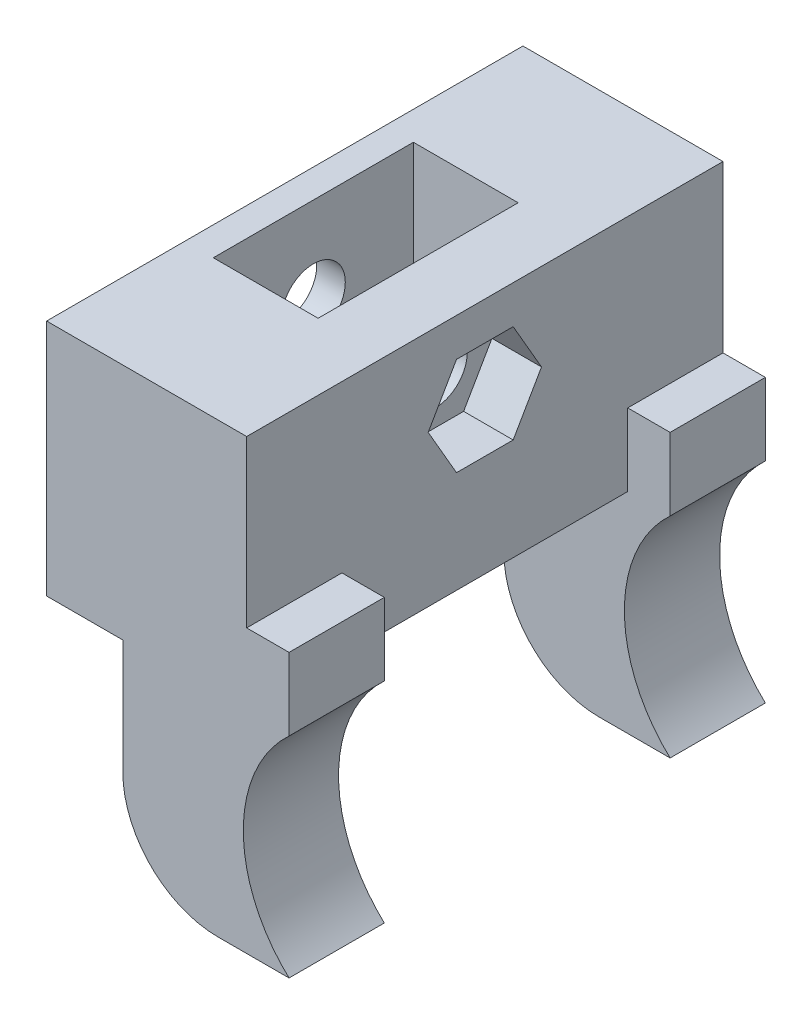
from build123d import *

# Parameters (mm, degrees)
BOSS_EXTRUDE1_DEPTH     = 25
SKETCH3_W               = 11
SKETCH3_H               = 21
CUT_EXTRUDE1_DEPTH      = 18.3
CUT_EXTRUDE3_REACH      = 64.634
SKETCH7_W               = 32.447843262
SKETCH7_H               = 30
CUT_EXTRUDE5_DEPTH      = 69.047977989
CUT_EXTRUDE5_DEPTH_BACK = 69.047977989
SKETCH13_R              = 3.35
CUT_EXTRUDE6_DEPTH      = 5.2
CUT_EXTRUDE7_REACH      = 52.895
CUT_EXTRUDE7_END_RADIUS = 15
SKETCH17_W              = 4.447843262
SKETCH17_H              = 30


with BuildPart() as part:
    # Sketch2 → Boss-Extrude1 (new, symmetric)
    with BuildSketch(Plane.XY):
        with BuildLine():
            Line((-33, -12.174501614), (-12, -12.174501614))
            Line((-12, -12.174501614), (-12, -29.572679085))
            Line((-12, -29.572679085), (-7.552156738, -29.572679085))
            Line((-7.552156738, -29.572679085), (-7.552156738, -37.174501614))
            ThreePointArc((-7.552156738, -37.174501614), (-12.354117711, -48.174501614), (-7.552156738, -59.174501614))
            Line((-7.552156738, -59.174501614), (-15, -59.174501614))
            ThreePointArc((-15, -59.174501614), (-22.071067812, -56.245569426), (-25, -49.174501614))
            Line((-25, -49.174501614), (-25, -37.174501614))
            Line((-25, -37.174501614), (-33, -37.174501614))
            Line((-33, -37.174501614), (-33, -12.174501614))
        make_face()
    extrude(amount=BOSS_EXTRUDE1_DEPTH, both=True)

    # Sketch3 → Cut-Extrude1 (cut)
    with BuildSketch(Plane(origin=(0, -12.174501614, 0), x_dir=(1, 0, 0), z_dir=(0, 1, 0))):
        with Locations((-24.5, 0)):
            Rectangle(SKETCH3_W, SKETCH3_H)
    extrude(amount=-CUT_EXTRUDE1_DEPTH, mode=Mode.SUBTRACT)

    # Cut-Extrude3: up to this face of the body (flat: up to its plane)
    cut_extrude3_end = Plane(part.part.faces().sort_by_distance((-29, -37.174501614, 0))[0])
    # Sketch7 → Cut-Extrude3 (cut, up to the picked face)
    with BuildSketch(Plane.XZ.offset(59.174501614), mode=Mode.PRIVATE) as cut_extrude3_sk1:
        with Locations((-23.776078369, 0)):
            Rectangle(SKETCH7_W, SKETCH7_H)
    cut_extrude3_tool1 = split(extrude(cut_extrude3_sk1.sketch, amount=-CUT_EXTRUDE3_REACH, mode=Mode.PRIVATE), bisect_by=cut_extrude3_end, keep=Keep.BOTH, mode=Mode.PRIVATE)
    add(cut_extrude3_tool1.solids().sort_by(Axis((-23.776078, -59.174502, 0), (0, 1, 0)))[0], mode=Mode.SUBTRACT)

    # Sketch13 → Cut-Extrude5 (cut, two sides: drawn at the far end of the back side and taken through both)
    with BuildSketch(Plane(origin=(-30, 0, 0), x_dir=(0, 0, -1), z_dir=(1, 0, 0)).offset(-CUT_EXTRUDE5_DEPTH_BACK)):
        with Locations((0, -21.324501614)):
            Circle(SKETCH13_R)
    extrude(amount=CUT_EXTRUDE5_DEPTH + CUT_EXTRUDE5_DEPTH_BACK, mode=Mode.SUBTRACT)

    # Sketch14 → Cut-Extrude6 (cut)
    with BuildSketch(Plane(origin=(-12, 0, 0), x_dir=(0, 0, -1), z_dir=(1, 0, 0))):
        Polygon((5.946707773, -21.324501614), (2.973353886, -16.174501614), (-2.973353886, -16.174501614), (-5.946707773, -21.324501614), (-2.973353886, -26.474501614), (2.973353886, -26.474501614), align=None)
    extrude(amount=-CUT_EXTRUDE6_DEPTH, mode=Mode.SUBTRACT)

    # Cut-Extrude7: up to this cylinder (the profile starts outside it)
    cut_extrude7_end = Plane(origin=(2.645882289, -48.174501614, 0), z_dir=(0, 0, 1)) * Cylinder(CUT_EXTRUDE7_END_RADIUS, 136.79, mode=Mode.PRIVATE)
    # Sketch17 → Cut-Extrude7 (cut, up to the surface)
    with BuildSketch(Plane(origin=(0, -29.572679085, 0), x_dir=(1, 0, 0), z_dir=(0, 1, 0)), mode=Mode.PRIVATE) as cut_extrude7_sk1:
        with Locations((-9.776078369, 0)):
            Rectangle(SKETCH17_W, SKETCH17_H)
    cut_extrude7_tool1 = extrude(cut_extrude7_sk1.sketch, amount=-CUT_EXTRUDE7_REACH, mode=Mode.PRIVATE) - cut_extrude7_end
    add(cut_extrude7_tool1.solids().sort_by_distance((-9.776078, -29.572679, 0))[0], mode=Mode.SUBTRACT)


solid = part.part
